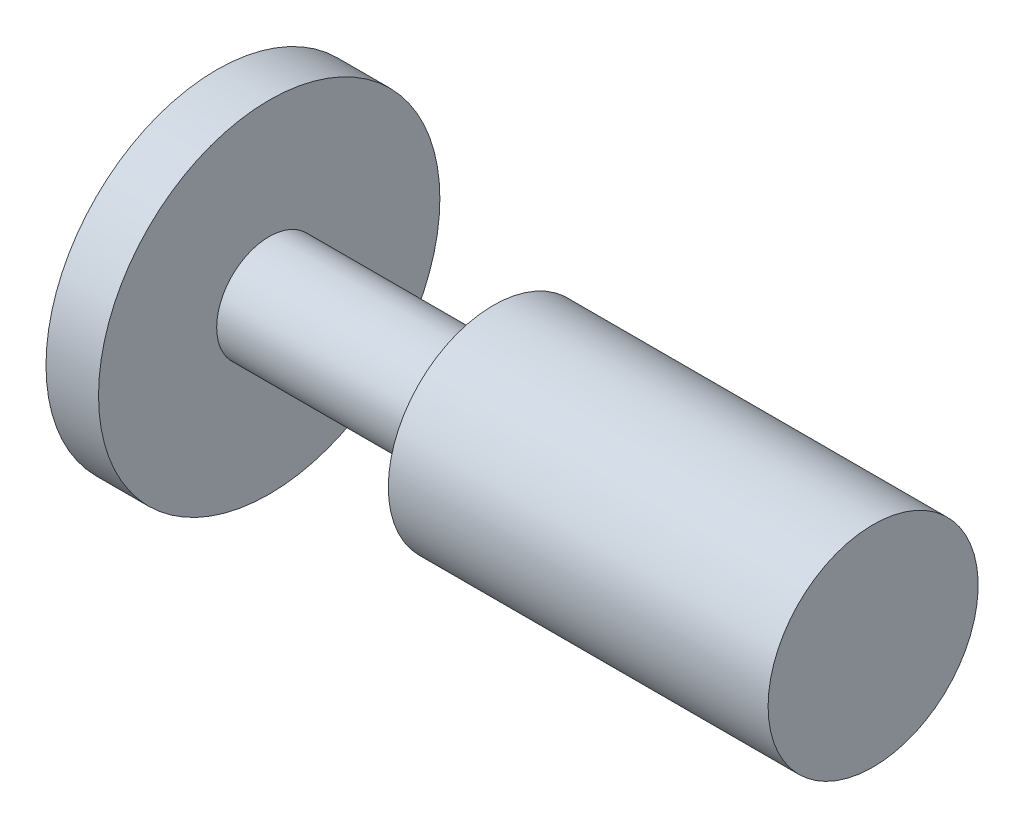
ISO-10303-21;
HEADER;
FILE_DESCRIPTION(('STEP AP214'),'2;1');
FILE_NAME('part.step','',(''),(''),'','','');
FILE_SCHEMA(('AUTOMOTIVE_DESIGN { 1 0 10303 214 1 1 1 1 }'));
ENDSEC;
DATA;
#1=APPLICATION_CONTEXT('core data for automotive mechanical design processes');
#2=APPLICATION_PROTOCOL_DEFINITION('international standard','automotive_design',2000,#1);
#3=PRODUCT_CONTEXT('',#1,'mechanical');
#4=PRODUCT('Part','Part','',(#3));
#5=PRODUCT_RELATED_PRODUCT_CATEGORY('part','',(#4));
#6=PRODUCT_DEFINITION_FORMATION('','',#4);
#7=PRODUCT_DEFINITION_CONTEXT('part definition',#1,'design');
#8=PRODUCT_DEFINITION('design','',#6,#7);
#9=PRODUCT_DEFINITION_SHAPE('','',#8);
#10=(LENGTH_UNIT() NAMED_UNIT(*) SI_UNIT(.MILLI.,.METRE.));
#11=(NAMED_UNIT(*) PLANE_ANGLE_UNIT() SI_UNIT($,.RADIAN.));
#12=(NAMED_UNIT(*) SI_UNIT($,.STERADIAN.) SOLID_ANGLE_UNIT());
#13=UNCERTAINTY_MEASURE_WITH_UNIT(LENGTH_MEASURE(1.E-05),#10,'distance_accuracy_value','');
#14=(GEOMETRIC_REPRESENTATION_CONTEXT(3) GLOBAL_UNCERTAINTY_ASSIGNED_CONTEXT((#13)) GLOBAL_UNIT_ASSIGNED_CONTEXT((#10,
#11,#12)) REPRESENTATION_CONTEXT('',''));
#15=CARTESIAN_POINT('',(0.,0.,0.));
#16=DIRECTION('',(0.,0.,1.));
#17=DIRECTION('',(1.,0.,0.));
#18=AXIS2_PLACEMENT_3D('',#15,#16,#17);
#19=CARTESIAN_POINT('',(0.,0.,0.));
#20=DIRECTION('',(1.,0.,0.));
#21=DIRECTION('',(0.,0.,-1.));
#22=AXIS2_PLACEMENT_3D('',#19,#20,#21);
#23=PLANE('',#22);
#24=CARTESIAN_POINT('',(0.,0.,0.));
#25=DIRECTION('',(-1.,0.,0.));
#26=DIRECTION('',(0.,0.,1.));
#27=AXIS2_PLACEMENT_3D('',#24,#25,#26);
#28=CIRCLE('',#27,32.5);
#29=CARTESIAN_POINT('',(0.,0.,32.5));
#30=VERTEX_POINT('',#29);
#31=EDGE_CURVE('E10',#30,#30,#28,.T.);
#32=ORIENTED_EDGE('',*,*,#31,.T.);
#33=EDGE_LOOP('',(#32));
#34=FACE_BOUND('',#33,.T.);
#35=ADVANCED_FACE('F30',(#34),#23,.F.);
#36=CARTESIAN_POINT('',(-18.0553016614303,0.,0.));
#37=DIRECTION('',(-1.,0.,0.));
#38=DIRECTION('',(0.,0.,1.));
#39=AXIS2_PLACEMENT_3D('',#36,#37,#38);
#40=CYLINDRICAL_SURFACE('',#39,32.5);
#41=ORIENTED_EDGE('',*,*,#31,.F.);
#42=EDGE_LOOP('',(#41));
#43=FACE_BOUND('',#42,.T.);
#44=CARTESIAN_POINT('',(10.,0.,0.));
#45=DIRECTION('',(-1.,0.,0.));
#46=DIRECTION('',(0.,0.,1.));
#47=AXIS2_PLACEMENT_3D('',#44,#45,#46);
#48=CIRCLE('',#47,32.5);
#49=CARTESIAN_POINT('',(10.,0.,32.5));
#50=VERTEX_POINT('',#49);
#51=EDGE_CURVE('E36',#50,#50,#48,.T.);
#52=ORIENTED_EDGE('',*,*,#51,.T.);
#53=EDGE_LOOP('',(#52));
#54=FACE_BOUND('',#53,.T.);
#55=ADVANCED_FACE('F68',(#43,#54),#40,.T.);
#56=CARTESIAN_POINT('',(10.,32.5,0.));
#57=DIRECTION('',(-1.,0.,0.));
#58=DIRECTION('',(0.,0.,1.));
#59=AXIS2_PLACEMENT_3D('',#56,#57,#58);
#60=PLANE('',#59);
#61=ORIENTED_EDGE('',*,*,#51,.F.);
#62=EDGE_LOOP('',(#61));
#63=FACE_BOUND('',#62,.T.);
#64=CARTESIAN_POINT('',(10.,0.,0.));
#65=DIRECTION('',(-1.,0.,0.));
#66=DIRECTION('',(0.,0.,1.));
#67=AXIS2_PLACEMENT_3D('',#64,#65,#66);
#68=CIRCLE('',#67,10.);
#69=CARTESIAN_POINT('',(10.,0.,10.));
#70=VERTEX_POINT('',#69);
#71=EDGE_CURVE('E40',#70,#70,#68,.T.);
#72=ORIENTED_EDGE('',*,*,#71,.T.);
#73=EDGE_LOOP('',(#72));
#74=FACE_BOUND('',#73,.T.);
#75=ADVANCED_FACE('F72',(#63,#74),#60,.F.);
#76=CARTESIAN_POINT('',(-18.0553016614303,0.,0.));
#77=DIRECTION('',(-1.,0.,0.));
#78=DIRECTION('',(0.,0.,1.));
#79=AXIS2_PLACEMENT_3D('',#76,#77,#78);
#80=CYLINDRICAL_SURFACE('',#79,10.);
#81=ORIENTED_EDGE('',*,*,#71,.F.);
#82=EDGE_LOOP('',(#81));
#83=FACE_BOUND('',#82,.T.);
#84=CARTESIAN_POINT('',(50.,0.,0.));
#85=DIRECTION('',(-1.,0.,0.));
#86=DIRECTION('',(0.,0.,1.));
#87=AXIS2_PLACEMENT_3D('',#84,#85,#86);
#88=CIRCLE('',#87,10.);
#89=CARTESIAN_POINT('',(50.,0.,10.));
#90=VERTEX_POINT('',#89);
#91=EDGE_CURVE('E44',#90,#90,#88,.T.);
#92=ORIENTED_EDGE('',*,*,#91,.T.);
#93=EDGE_LOOP('',(#92));
#94=FACE_BOUND('',#93,.T.);
#95=ADVANCED_FACE('F77',(#83,#94),#80,.T.);
#96=CARTESIAN_POINT('',(52.6794919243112,0.,0.));
#97=DIRECTION('',(1.,0.,0.));
#98=DIRECTION('',(0.,0.,-1.));
#99=AXIS2_PLACEMENT_3D('',#96,#97,#98);
#100=CONICAL_SURFACE('',#99,20.,1.30899693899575);
#101=ORIENTED_EDGE('',*,*,#91,.F.);
#102=EDGE_LOOP('',(#101));
#103=FACE_BOUND('',#102,.T.);
#104=CARTESIAN_POINT('',(52.6794919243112,0.,0.));
#105=DIRECTION('',(-1.,0.,0.));
#106=DIRECTION('',(0.,0.,1.));
#107=AXIS2_PLACEMENT_3D('',#104,#105,#106);
#108=CIRCLE('',#107,20.);
#109=CARTESIAN_POINT('',(52.6794919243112,0.,20.));
#110=VERTEX_POINT('',#109);
#111=EDGE_CURVE('E49',#110,#110,#108,.T.);
#112=ORIENTED_EDGE('',*,*,#111,.T.);
#113=EDGE_LOOP('',(#112));
#114=FACE_BOUND('',#113,.T.);
#115=ADVANCED_FACE('F64',(#103,#114),#100,.T.);
#116=CARTESIAN_POINT('',(-18.0553016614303,0.,0.));
#117=DIRECTION('',(-1.,0.,0.));
#118=DIRECTION('',(0.,0.,1.));
#119=AXIS2_PLACEMENT_3D('',#116,#117,#118);
#120=CYLINDRICAL_SURFACE('',#119,20.);
#121=ORIENTED_EDGE('',*,*,#111,.F.);
#122=EDGE_LOOP('',(#121));
#123=FACE_BOUND('',#122,.T.);
#124=CARTESIAN_POINT('',(125.,0.,0.));
#125=DIRECTION('',(-1.,0.,0.));
#126=DIRECTION('',(0.,0.,1.));
#127=AXIS2_PLACEMENT_3D('',#124,#125,#126);
#128=CIRCLE('',#127,20.);
#129=CARTESIAN_POINT('',(125.,0.,20.));
#130=VERTEX_POINT('',#129);
#131=EDGE_CURVE('E52',#130,#130,#128,.T.);
#132=ORIENTED_EDGE('',*,*,#131,.T.);
#133=EDGE_LOOP('',(#132));
#134=FACE_BOUND('',#133,.T.);
#135=ADVANCED_FACE('F56',(#123,#134),#120,.T.);
#136=CARTESIAN_POINT('',(125.,20.,0.));
#137=DIRECTION('',(-1.,0.,0.));
#138=DIRECTION('',(0.,0.,1.));
#139=AXIS2_PLACEMENT_3D('',#136,#137,#138);
#140=PLANE('',#139);
#141=ORIENTED_EDGE('',*,*,#131,.F.);
#142=EDGE_LOOP('',(#141));
#143=FACE_BOUND('',#142,.T.);
#144=ADVANCED_FACE('F58',(#143),#140,.F.);
#145=CLOSED_SHELL('',(#35,#55,#75,#95,#115,#135,#144));
#146=MANIFOLD_SOLID_BREP('B2',#145);
#147=ADVANCED_BREP_SHAPE_REPRESENTATION('',(#18,#146),#14);
#148=SHAPE_DEFINITION_REPRESENTATION(#9,#147);
ENDSEC;
END-ISO-10303-21;
